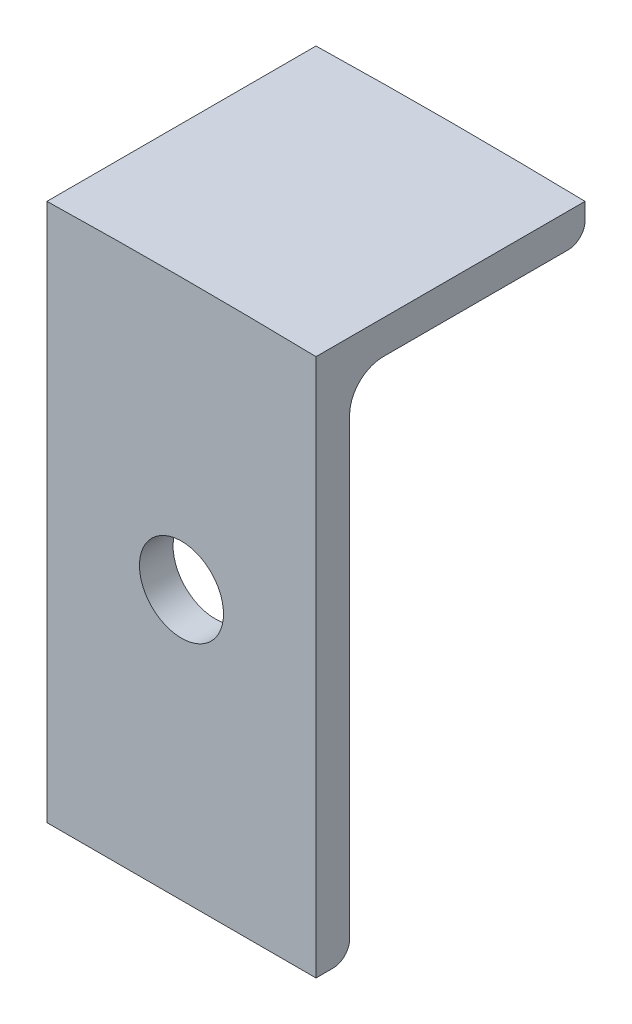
from build123d import *

# Parameters (mm, degrees)
BOSS_EXTRUDE1_DEPTH            = 12.7
F_5_16_0_3125_DIAMETER_HOLE1_D = 7.9375
BOSS_EXTRUDE2_DEPTH            = 25.4


with BuildPart() as part:
    # Sketch1 → Boss-Extrude1 (new, symmetric)
    with BuildSketch(Plane(origin=(0, 0, 0), x_dir=(0, 0, -1), z_dir=(1, 0, 0))):
        with BuildLine():
            Line((0, 0), (0, 50.8))
            Line((0, 50.8), (25.4, 50.8))
            Line((25.4, 50.8), (25.4, 49.2125))
            ThreePointArc((25.4, 49.2125), (24.935032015, 48.089967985), (23.8125, 47.625))
            Line((23.8125, 47.625), (6.35, 47.625))
            ThreePointArc((6.35, 47.625), (4.10493597, 46.69506403), (3.175, 44.45))
            Line((3.175, 44.45), (3.175, 1.5875))
            ThreePointArc((3.175, 1.5875), (2.710032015, 0.464967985), (1.5875, 0))
            Line((1.5875, 0), (0, 0))
        make_face()
    extrude(amount=BOSS_EXTRUDE1_DEPTH, both=True)

    # 5_16 _0.3125_ Diameter Hole1 (through all)
    with Locations(Plane.XY):
        with Locations((0, 25.4)):
            Hole(F_5_16_0_3125_DIAMETER_HOLE1_D / 2)

    # Sketch4 → Boss-Extrude2 (add)
    with BuildSketch(Plane.XY):
        with BuildLine():
            Line((-12.7, 50.8), (12.7, 50.8))
            ThreePointArc((12.7, 50.8), (0, 50.933699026), (-12.7, 50.8))
        make_face()
    extrude(amount=-BOSS_EXTRUDE2_DEPTH)


solid = part.part
